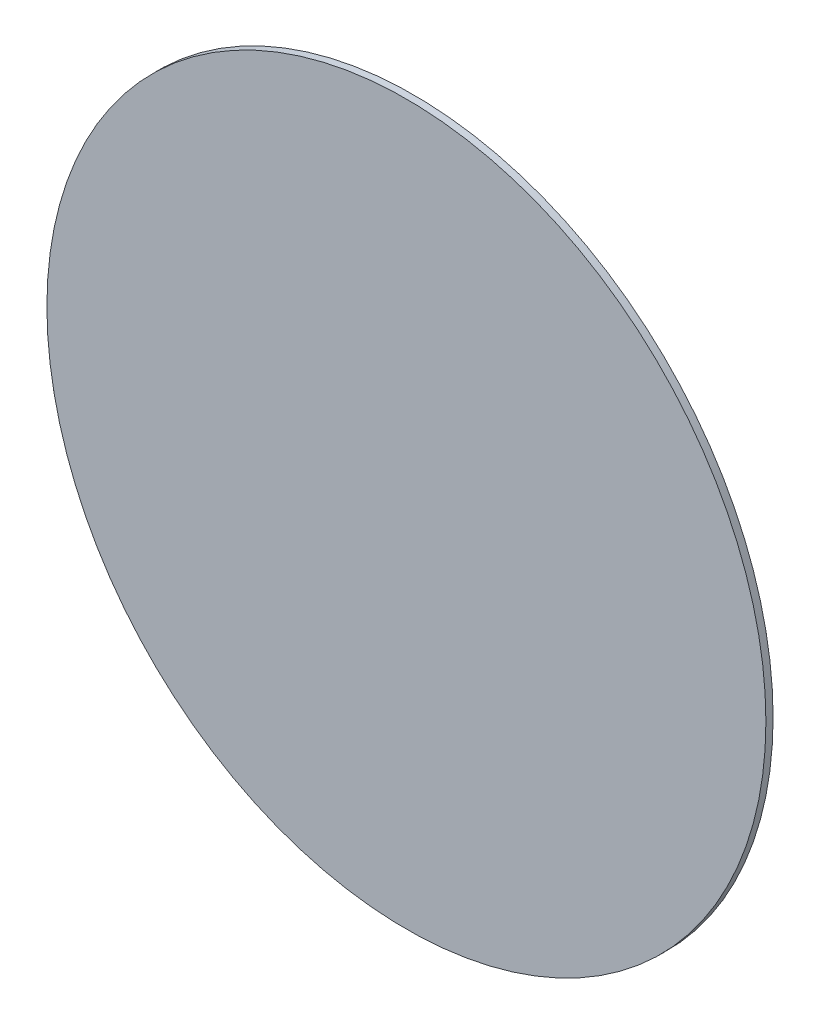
from build123d import *

# Parameters (mm, degrees)
SKETCH1_R      = 250
EXTRUDE1_DEPTH = 5


with BuildPart() as part:
    # Sketch1 → Extrude1 (new body)
    with BuildSketch(Plane.XY):
        Circle(SKETCH1_R)
    extrude(amount=EXTRUDE1_DEPTH)


solid = part.part
